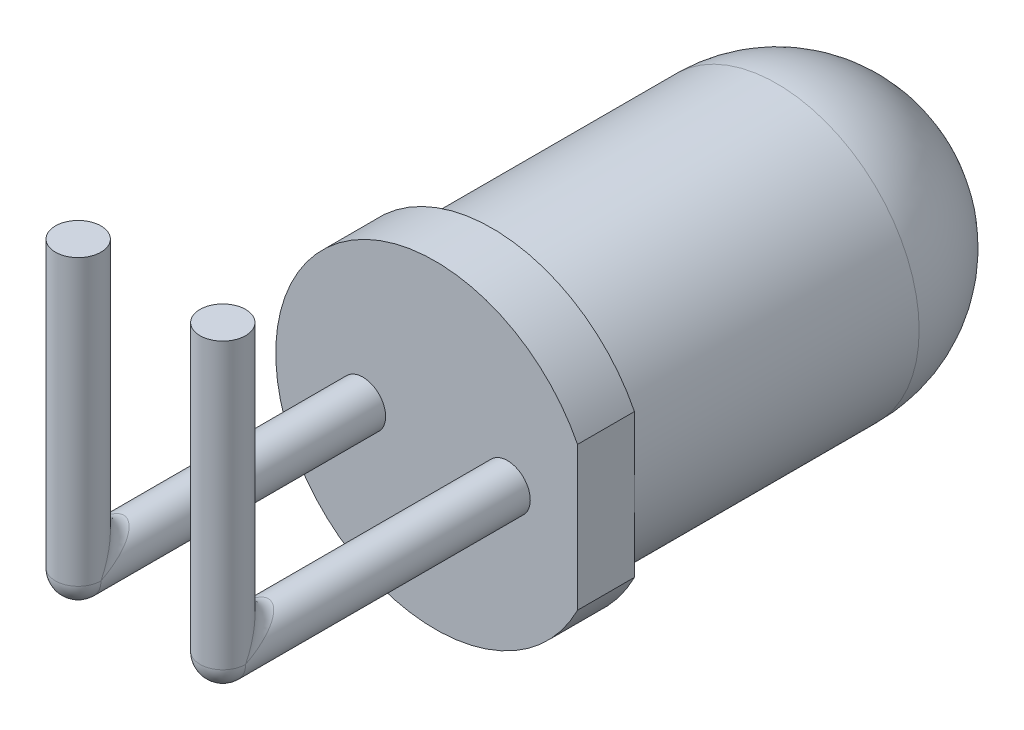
ISO-10303-21;
HEADER;
FILE_DESCRIPTION(('STEP AP214'),'2;1');
FILE_NAME('part.step','',(''),(''),'','','');
FILE_SCHEMA(('AUTOMOTIVE_DESIGN { 1 0 10303 214 1 1 1 1 }'));
ENDSEC;
DATA;
#1=APPLICATION_CONTEXT('core data for automotive mechanical design processes');
#2=APPLICATION_PROTOCOL_DEFINITION('international standard','automotive_design',2000,#1);
#3=PRODUCT_CONTEXT('',#1,'mechanical');
#4=PRODUCT('Part','Part','',(#3));
#5=PRODUCT_RELATED_PRODUCT_CATEGORY('part','',(#4));
#6=PRODUCT_DEFINITION_FORMATION('','',#4);
#7=PRODUCT_DEFINITION_CONTEXT('part definition',#1,'design');
#8=PRODUCT_DEFINITION('design','',#6,#7);
#9=PRODUCT_DEFINITION_SHAPE('','',#8);
#10=(LENGTH_UNIT() NAMED_UNIT(*) SI_UNIT(.MILLI.,.METRE.));
#11=(NAMED_UNIT(*) PLANE_ANGLE_UNIT() SI_UNIT($,.RADIAN.));
#12=(NAMED_UNIT(*) SI_UNIT($,.STERADIAN.) SOLID_ANGLE_UNIT());
#13=UNCERTAINTY_MEASURE_WITH_UNIT(LENGTH_MEASURE(1.E-05),#10,'distance_accuracy_value','');
#14=(GEOMETRIC_REPRESENTATION_CONTEXT(3) GLOBAL_UNCERTAINTY_ASSIGNED_CONTEXT((#13)) GLOBAL_UNIT_ASSIGNED_CONTEXT((#10,
#11,#12)) REPRESENTATION_CONTEXT('',''));
#15=CARTESIAN_POINT('',(0.,0.,0.));
#16=DIRECTION('',(0.,0.,1.));
#17=DIRECTION('',(1.,0.,0.));
#18=AXIS2_PLACEMENT_3D('',#15,#16,#17);
#19=CARTESIAN_POINT('',(0.,0.,8.5));
#20=DIRECTION('',(0.,0.,-1.));
#21=DIRECTION('',(-1.,0.,0.));
#22=AXIS2_PLACEMENT_3D('',#19,#20,#21);
#23=CYLINDRICAL_SURFACE('',#22,2.5);
#24=CARTESIAN_POINT('',(0.,0.,2.5));
#25=DIRECTION('',(0.,0.,-1.));
#26=DIRECTION('',(-1.,0.,0.));
#27=AXIS2_PLACEMENT_3D('',#24,#25,#26);
#28=CIRCLE('',#27,2.5);
#29=CARTESIAN_POINT('',(-2.5,0.,2.5));
#30=VERTEX_POINT('',#29);
#31=EDGE_CURVE('E100',#30,#30,#28,.F.);
#32=ORIENTED_EDGE('',*,*,#31,.T.);
#33=EDGE_LOOP('',(#32));
#34=FACE_BOUND('',#33,.T.);
#35=CARTESIAN_POINT('',(0.,0.,7.5));
#36=DIRECTION('',(0.,0.,1.));
#37=DIRECTION('',(1.,0.,0.));
#38=AXIS2_PLACEMENT_3D('',#35,#36,#37);
#39=CIRCLE('',#38,2.5);
#40=CARTESIAN_POINT('',(2.5,0.,7.5));
#41=VERTEX_POINT('',#40);
#42=EDGE_CURVE('E96',#41,#41,#39,.T.);
#43=ORIENTED_EDGE('',*,*,#42,.F.);
#44=EDGE_LOOP('',(#43));
#45=FACE_BOUND('',#44,.T.);
#46=ADVANCED_FACE('F29',(#34,#45),#23,.T.);
#47=CARTESIAN_POINT('',(0.,0.,7.5));
#48=DIRECTION('',(0.,0.,1.));
#49=DIRECTION('',(1.,0.,0.));
#50=AXIS2_PLACEMENT_3D('',#47,#48,#49);
#51=PLANE('',#50);
#52=DIRECTION('',(0.,1.,0.));
#53=VECTOR('',#52,1.);
#54=CARTESIAN_POINT('',(2.5,1.26095202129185,7.5));
#55=LINE('',#54,#53);
#56=CARTESIAN_POINT('',(2.5,1.26095202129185,7.5));
#57=VERTEX_POINT('',#56);
#58=EDGE_CURVE('E91',#41,#57,#55,.T.);
#59=ORIENTED_EDGE('',*,*,#58,.F.);
#60=ORIENTED_EDGE('',*,*,#42,.T.);
#61=CARTESIAN_POINT('',(2.5,-1.26095202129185,7.5));
#62=VERTEX_POINT('',#61);
#63=EDGE_CURVE('E81',#62,#41,#55,.T.);
#64=ORIENTED_EDGE('',*,*,#63,.F.);
#65=CARTESIAN_POINT('',(0.,0.,7.5));
#66=DIRECTION('',(0.,0.,1.));
#67=DIRECTION('',(1.,0.,0.));
#68=AXIS2_PLACEMENT_3D('',#65,#66,#67);
#69=CIRCLE('',#68,2.8);
#70=EDGE_CURVE('E75',#57,#62,#69,.T.);
#71=ORIENTED_EDGE('',*,*,#70,.F.);
#72=EDGE_LOOP('',(#59,#60,#64,#71));
#73=FACE_BOUND('',#72,.T.);
#74=ADVANCED_FACE('F141',(#73),#51,.F.);
#75=CARTESIAN_POINT('',(2.5,1.26095202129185,7.5));
#76=DIRECTION('',(1.,0.,0.));
#77=DIRECTION('',(0.,0.,-1.));
#78=AXIS2_PLACEMENT_3D('',#75,#76,#77);
#79=PLANE('',#78);
#80=ORIENTED_EDGE('',*,*,#63,.T.);
#81=ORIENTED_EDGE('',*,*,#58,.T.);
#82=DIRECTION('',(0.,0.,1.));
#83=VECTOR('',#82,1.);
#84=CARTESIAN_POINT('',(2.5,1.26095202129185,7.5));
#85=LINE('',#84,#83);
#86=CARTESIAN_POINT('',(2.5,1.26095202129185,8.5));
#87=VERTEX_POINT('',#86);
#88=EDGE_CURVE('E80',#57,#87,#85,.T.);
#89=ORIENTED_EDGE('',*,*,#88,.T.);
#90=DIRECTION('',(0.,1.,0.));
#91=VECTOR('',#90,1.);
#92=CARTESIAN_POINT('',(2.5,1.26095202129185,8.5));
#93=LINE('',#92,#91);
#94=CARTESIAN_POINT('',(2.5,-1.26095202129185,8.5));
#95=VERTEX_POINT('',#94);
#96=EDGE_CURVE('E85',#95,#87,#93,.T.);
#97=ORIENTED_EDGE('',*,*,#96,.F.);
#98=DIRECTION('',(0.,0.,1.));
#99=VECTOR('',#98,1.);
#100=CARTESIAN_POINT('',(2.5,-1.26095202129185,7.5));
#101=LINE('',#100,#99);
#102=EDGE_CURVE('E69',#62,#95,#101,.T.);
#103=ORIENTED_EDGE('',*,*,#102,.F.);
#104=EDGE_LOOP('',(#80,#81,#89,#97,#103));
#105=FACE_BOUND('',#104,.T.);
#106=ADVANCED_FACE('F89',(#105),#79,.T.);
#107=CARTESIAN_POINT('',(0.,0.,7.5));
#108=DIRECTION('',(0.,0.,1.));
#109=DIRECTION('',(1.,0.,0.));
#110=AXIS2_PLACEMENT_3D('',#107,#108,#109);
#111=CYLINDRICAL_SURFACE('',#110,2.8);
#112=CARTESIAN_POINT('',(0.,0.,8.5));
#113=DIRECTION('',(0.,0.,1.));
#114=DIRECTION('',(1.,0.,0.));
#115=AXIS2_PLACEMENT_3D('',#112,#113,#114);
#116=CIRCLE('',#115,2.8);
#117=EDGE_CURVE('E73',#87,#95,#116,.T.);
#118=ORIENTED_EDGE('',*,*,#117,.F.);
#119=ORIENTED_EDGE('',*,*,#88,.F.);
#120=ORIENTED_EDGE('',*,*,#70,.T.);
#121=ORIENTED_EDGE('',*,*,#102,.T.);
#122=EDGE_LOOP('',(#118,#119,#120,#121));
#123=FACE_BOUND('',#122,.T.);
#124=ADVANCED_FACE('F71',(#123),#111,.T.);
#125=CARTESIAN_POINT('',(0.,0.,8.5));
#126=DIRECTION('',(0.,0.,1.));
#127=DIRECTION('',(1.,0.,0.));
#128=AXIS2_PLACEMENT_3D('',#125,#126,#127);
#129=PLANE('',#128);
#130=CARTESIAN_POINT('',(-1.27,0.,8.5));
#131=DIRECTION('',(0.,0.,1.));
#132=DIRECTION('',(1.,0.,0.));
#133=AXIS2_PLACEMENT_3D('',#130,#131,#132);
#134=CIRCLE('',#133,0.4);
#135=CARTESIAN_POINT('',(-0.87,0.,8.5));
#136=VERTEX_POINT('',#135);
#137=EDGE_CURVE('E108',#136,#136,#134,.T.);
#138=ORIENTED_EDGE('',*,*,#137,.F.);
#139=EDGE_LOOP('',(#138));
#140=FACE_BOUND('',#139,.T.);
#141=CARTESIAN_POINT('',(1.27,0.,8.5));
#142=DIRECTION('',(0.,0.,1.));
#143=DIRECTION('',(1.,0.,0.));
#144=AXIS2_PLACEMENT_3D('',#141,#142,#143);
#145=CIRCLE('',#144,0.4);
#146=CARTESIAN_POINT('',(1.67,0.,8.5));
#147=VERTEX_POINT('',#146);
#148=EDGE_CURVE('E103',#147,#147,#145,.T.);
#149=ORIENTED_EDGE('',*,*,#148,.F.);
#150=EDGE_LOOP('',(#149));
#151=FACE_BOUND('',#150,.T.);
#152=ORIENTED_EDGE('',*,*,#96,.T.);
#153=ORIENTED_EDGE('',*,*,#117,.T.);
#154=EDGE_LOOP('',(#152,#153));
#155=FACE_BOUND('',#154,.T.);
#156=ADVANCED_FACE('F84',(#140,#151,#155),#129,.T.);
#157=CARTESIAN_POINT('',(0.,0.,2.5));
#158=DIRECTION('',(0.,0.,1.));
#159=DIRECTION('',(1.,0.,0.));
#160=AXIS2_PLACEMENT_3D('',#157,#158,#159);
#161=SPHERICAL_SURFACE('',#160,2.5);
#162=ORIENTED_EDGE('',*,*,#31,.F.);
#163=EDGE_LOOP('',(#162));
#164=FACE_BOUND('',#163,.T.);
#165=ADVANCED_FACE('F154',(#164),#161,.T.);
#166=CARTESIAN_POINT('',(1.27,0.,13.5));
#167=DIRECTION('',(0.,1.,0.));
#168=DIRECTION('',(0.,0.,1.));
#169=AXIS2_PLACEMENT_3D('',#166,#167,#168);
#170=CYLINDRICAL_SURFACE('',#169,0.4);
#171=CARTESIAN_POINT('',(1.27,0.,13.5));
#172=DIRECTION('',(0.,-0.447213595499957,-0.894427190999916));
#173=DIRECTION('',(0.,0.894427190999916,-0.447213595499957));
#174=AXIS2_PLACEMENT_3D('',#171,#172,#173);
#175=ELLIPSE('',#174,0.894427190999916,0.4);
#176=CARTESIAN_POINT('',(1.67,0.,13.5));
#177=VERTEX_POINT('',#176);
#178=CARTESIAN_POINT('',(0.87,0.,13.5));
#179=VERTEX_POINT('',#178);
#180=EDGE_CURVE('E104',#177,#179,#175,.F.);
#181=ORIENTED_EDGE('',*,*,#180,.T.);
#182=CARTESIAN_POINT('',(1.27,0.,13.5));
#183=DIRECTION('',(0.,1.,0.));
#184=DIRECTION('',(0.,0.,1.));
#185=AXIS2_PLACEMENT_3D('',#182,#183,#184);
#186=CIRCLE('',#185,0.4);
#187=EDGE_CURVE('E107',#179,#177,#186,.T.);
#188=ORIENTED_EDGE('',*,*,#187,.T.);
#189=EDGE_LOOP('',(#181,#188));
#190=FACE_BOUND('',#189,.T.);
#191=CARTESIAN_POINT('',(1.27,5.,13.5));
#192=DIRECTION('',(0.,1.,0.));
#193=DIRECTION('',(0.,0.,1.));
#194=AXIS2_PLACEMENT_3D('',#191,#192,#193);
#195=CIRCLE('',#194,0.4);
#196=CARTESIAN_POINT('',(1.27,5.,13.9));
#197=VERTEX_POINT('',#196);
#198=EDGE_CURVE('E87',#197,#197,#195,.F.);
#199=ORIENTED_EDGE('',*,*,#198,.T.);
#200=EDGE_LOOP('',(#199));
#201=FACE_BOUND('',#200,.T.);
#202=ADVANCED_FACE('F155',(#190,#201),#170,.T.);
#203=CARTESIAN_POINT('',(1.27,0.,14.6313708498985));
#204=DIRECTION('',(0.,0.,-1.));
#205=DIRECTION('',(0.,1.,0.));
#206=AXIS2_PLACEMENT_3D('',#203,#204,#205);
#207=CYLINDRICAL_SURFACE('',#206,0.4);
#208=ORIENTED_EDGE('',*,*,#148,.T.);
#209=EDGE_LOOP('',(#208));
#210=FACE_BOUND('',#209,.T.);
#211=CARTESIAN_POINT('',(1.27,0.,13.5));
#212=DIRECTION('',(0.,0.,-1.));
#213=DIRECTION('',(0.,1.,0.));
#214=AXIS2_PLACEMENT_3D('',#211,#212,#213);
#215=CIRCLE('',#214,0.4);
#216=EDGE_CURVE('E111',#177,#179,#215,.T.);
#217=ORIENTED_EDGE('',*,*,#216,.T.);
#218=CARTESIAN_POINT('',(1.27,0.,13.5));
#219=DIRECTION('',(0.,-0.894427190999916,-0.447213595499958));
#220=DIRECTION('',(0.,0.447213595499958,-0.894427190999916));
#221=AXIS2_PLACEMENT_3D('',#218,#219,#220);
#222=ELLIPSE('',#221,0.894427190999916,0.4);
#223=EDGE_CURVE('E114',#179,#177,#222,.T.);
#224=ORIENTED_EDGE('',*,*,#223,.T.);
#225=EDGE_LOOP('',(#217,#224));
#226=FACE_BOUND('',#225,.T.);
#227=ADVANCED_FACE('F161',(#210,#226),#207,.T.);
#228=CARTESIAN_POINT('',(1.27,5.,13.5));
#229=DIRECTION('',(0.,1.,0.));
#230=DIRECTION('',(0.,0.,1.));
#231=AXIS2_PLACEMENT_3D('',#228,#229,#230);
#232=PLANE('',#231);
#233=ORIENTED_EDGE('',*,*,#198,.F.);
#234=EDGE_LOOP('',(#233));
#235=FACE_BOUND('',#234,.T.);
#236=ADVANCED_FACE('F204',(#235),#232,.T.);
#237=CARTESIAN_POINT('',(-1.27,0.,13.5));
#238=DIRECTION('',(0.,1.,0.));
#239=DIRECTION('',(0.,0.,1.));
#240=AXIS2_PLACEMENT_3D('',#237,#238,#239);
#241=CYLINDRICAL_SURFACE('',#240,0.4);
#242=CARTESIAN_POINT('',(-1.27,0.,13.5));
#243=DIRECTION('',(0.,-0.447213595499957,-0.894427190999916));
#244=DIRECTION('',(0.,0.894427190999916,-0.447213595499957));
#245=AXIS2_PLACEMENT_3D('',#242,#243,#244);
#246=ELLIPSE('',#245,0.894427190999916,0.4);
#247=CARTESIAN_POINT('',(-0.87,0.,13.5));
#248=VERTEX_POINT('',#247);
#249=CARTESIAN_POINT('',(-1.67,0.,13.5));
#250=VERTEX_POINT('',#249);
#251=EDGE_CURVE('E117',#248,#250,#246,.F.);
#252=ORIENTED_EDGE('',*,*,#251,.T.);
#253=CARTESIAN_POINT('',(-1.27,0.,13.5));
#254=DIRECTION('',(0.,1.,0.));
#255=DIRECTION('',(0.,0.,1.));
#256=AXIS2_PLACEMENT_3D('',#253,#254,#255);
#257=CIRCLE('',#256,0.4);
#258=EDGE_CURVE('E120',#250,#248,#257,.T.);
#259=ORIENTED_EDGE('',*,*,#258,.T.);
#260=EDGE_LOOP('',(#252,#259));
#261=FACE_BOUND('',#260,.T.);
#262=CARTESIAN_POINT('',(-1.27,5.,13.5));
#263=DIRECTION('',(0.,1.,0.));
#264=DIRECTION('',(0.,0.,1.));
#265=AXIS2_PLACEMENT_3D('',#262,#263,#264);
#266=CIRCLE('',#265,0.4);
#267=CARTESIAN_POINT('',(-1.27,5.,13.9));
#268=VERTEX_POINT('',#267);
#269=EDGE_CURVE('E263',#268,#268,#266,.F.);
#270=ORIENTED_EDGE('',*,*,#269,.T.);
#271=EDGE_LOOP('',(#270));
#272=FACE_BOUND('',#271,.T.);
#273=ADVANCED_FACE('F125',(#261,#272),#241,.T.);
#274=CARTESIAN_POINT('',(-1.27,0.,14.6313708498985));
#275=DIRECTION('',(0.,0.,-1.));
#276=DIRECTION('',(0.,1.,0.));
#277=AXIS2_PLACEMENT_3D('',#274,#275,#276);
#278=CYLINDRICAL_SURFACE('',#277,0.4);
#279=ORIENTED_EDGE('',*,*,#137,.T.);
#280=EDGE_LOOP('',(#279));
#281=FACE_BOUND('',#280,.T.);
#282=CARTESIAN_POINT('',(-1.27,0.,13.5));
#283=DIRECTION('',(0.,0.,-1.));
#284=DIRECTION('',(0.,1.,0.));
#285=AXIS2_PLACEMENT_3D('',#282,#283,#284);
#286=CIRCLE('',#285,0.4);
#287=EDGE_CURVE('E36',#248,#250,#286,.T.);
#288=ORIENTED_EDGE('',*,*,#287,.T.);
#289=CARTESIAN_POINT('',(-1.27,0.,13.5));
#290=DIRECTION('',(0.,-0.894427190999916,-0.447213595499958));
#291=DIRECTION('',(0.,0.447213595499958,-0.894427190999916));
#292=AXIS2_PLACEMENT_3D('',#289,#290,#291);
#293=ELLIPSE('',#292,0.894427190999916,0.4);
#294=EDGE_CURVE('E12',#250,#248,#293,.T.);
#295=ORIENTED_EDGE('',*,*,#294,.T.);
#296=EDGE_LOOP('',(#288,#295));
#297=FACE_BOUND('',#296,.T.);
#298=ADVANCED_FACE('F123',(#281,#297),#278,.T.);
#299=CARTESIAN_POINT('',(-1.27,5.,13.5));
#300=DIRECTION('',(0.,1.,0.));
#301=DIRECTION('',(0.,0.,1.));
#302=AXIS2_PLACEMENT_3D('',#299,#300,#301);
#303=PLANE('',#302);
#304=ORIENTED_EDGE('',*,*,#269,.F.);
#305=EDGE_LOOP('',(#304));
#306=FACE_BOUND('',#305,.T.);
#307=ADVANCED_FACE('F223',(#306),#303,.T.);
#308=CARTESIAN_POINT('',(1.27,0.,13.5));
#309=DIRECTION('',(0.,0.,1.));
#310=DIRECTION('',(1.,0.,0.));
#311=AXIS2_PLACEMENT_3D('',#308,#309,#310);
#312=SPHERICAL_SURFACE('',#311,0.4);
#313=ORIENTED_EDGE('',*,*,#187,.F.);
#314=ORIENTED_EDGE('',*,*,#216,.F.);
#315=EDGE_LOOP('',(#313,#314));
#316=FACE_BOUND('',#315,.T.);
#317=ADVANCED_FACE('F137',(#316),#312,.T.);
#318=CARTESIAN_POINT('',(1.67,0.,13.5));
#319=CARTESIAN_POINT('',(1.67,0.,13.5));
#320=CARTESIAN_POINT('',(1.67,0.,13.5));
#321=CARTESIAN_POINT('',(1.66999298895,0.0348517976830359,13.4825741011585));
#322=CARTESIAN_POINT('',(1.67005108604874,0.0261441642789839,13.473855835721));
#323=CARTESIAN_POINT('',(1.66999298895,0.0174258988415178,13.465148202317));
#324=CARTESIAN_POINT('',(1.66886070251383,0.0697124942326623,13.4651437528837));
#325=CARTESIAN_POINT('',(1.66772093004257,0.0523600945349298,13.4476399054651));
#326=CARTESIAN_POINT('',(1.66886070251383,0.034856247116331,13.4302875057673));
#327=CARTESIAN_POINT('',(1.66431458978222,0.138834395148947,13.4305828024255));
#328=CARTESIAN_POINT('',(1.65863330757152,0.103749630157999,13.396250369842));
#329=CARTESIAN_POINT('',(1.66431458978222,0.0694171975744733,13.3611656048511));
#330=CARTESIAN_POINT('',(1.66092023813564,0.173098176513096,13.4134509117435));
#331=CARTESIAN_POINT('',(1.65186272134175,0.129071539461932,13.3709284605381));
#332=CARTESIAN_POINT('',(1.66092023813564,0.0865490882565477,13.3269018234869));
#333=CARTESIAN_POINT('',(1.65189673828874,0.24044273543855,13.3797786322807));
#334=CARTESIAN_POINT('',(1.63414910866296,0.177786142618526,13.3222138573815));
#335=CARTESIAN_POINT('',(1.65189673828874,0.120221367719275,13.2595572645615));
#336=CARTESIAN_POINT('',(1.6463060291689,0.273533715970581,13.3632331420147));
#337=CARTESIAN_POINT('',(1.62318021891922,0.201325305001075,13.2986746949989));
#338=CARTESIAN_POINT('',(1.6463060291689,0.136766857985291,13.2264662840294));
#339=CARTESIAN_POINT('',(1.63296398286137,0.337956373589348,13.3310218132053));
#340=CARTESIAN_POINT('',(1.59763412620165,0.245616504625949,13.2543834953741));
#341=CARTESIAN_POINT('',(1.63296398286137,0.168978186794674,13.1620436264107));
#342=CARTESIAN_POINT('',(1.62526926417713,0.369311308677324,13.3153443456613));
#343=CARTESIAN_POINT('',(1.58301825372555,0.266510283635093,13.2334897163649));
#344=CARTESIAN_POINT('',(1.62526926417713,0.184655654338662,13.1306886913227));
#345=CARTESIAN_POINT('',(1.60783304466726,0.42971186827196,13.285144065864));
#346=CARTESIAN_POINT('',(1.55100028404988,0.304712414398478,13.1952875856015));
#347=CARTESIAN_POINT('',(1.60783304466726,0.21485593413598,13.070288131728));
#348=CARTESIAN_POINT('',(1.59816448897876,0.458799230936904,13.2706003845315));
#349=CARTESIAN_POINT('',(1.53354818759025,0.322154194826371,13.1778458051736));
#350=CARTESIAN_POINT('',(1.59816448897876,0.229399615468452,13.0412007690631));
#351=CARTESIAN_POINT('',(1.57692939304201,0.514147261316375,13.2429263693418));
#352=CARTESIAN_POINT('',(1.49701863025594,0.352779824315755,13.1472201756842));
#353=CARTESIAN_POINT('',(1.57692939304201,0.257073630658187,12.9858527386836));
#354=CARTESIAN_POINT('',(1.56544892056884,0.540473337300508,13.2297633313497));
#355=CARTESIAN_POINT('',(1.47788315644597,0.366083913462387,13.1339160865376));
#356=CARTESIAN_POINT('',(1.56544892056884,0.270236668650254,12.9595266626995));
#357=CARTESIAN_POINT('',(1.54077355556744,0.589823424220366,13.2050882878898));
#358=CARTESIAN_POINT('',(1.43951787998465,0.388004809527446,13.1119951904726));
#359=CARTESIAN_POINT('',(1.54077355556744,0.294911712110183,12.9101765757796));
#360=CARTESIAN_POINT('',(1.52767253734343,0.612940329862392,13.1935298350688));
#361=CARTESIAN_POINT('',(1.42022816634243,0.396723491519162,13.1032765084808));
#362=CARTESIAN_POINT('',(1.52767253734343,0.306470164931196,12.8870596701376));
#363=CARTESIAN_POINT('',(1.49997342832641,0.655447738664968,13.1722761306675));
#364=CARTESIAN_POINT('',(1.38341468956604,0.409472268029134,13.0905277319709));
#365=CARTESIAN_POINT('',(1.49997342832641,0.327723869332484,12.844552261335));
#366=CARTESIAN_POINT('',(1.48546909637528,0.674959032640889,13.1625204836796));
#367=CARTESIAN_POINT('',(1.36583761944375,0.413582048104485,13.0864179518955));
#368=CARTESIAN_POINT('',(1.48546909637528,0.337479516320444,12.8250409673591));
#369=CARTESIAN_POINT('',(1.45521408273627,0.709892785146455,13.1450536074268));
#370=CARTESIAN_POINT('',(1.33439698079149,0.417771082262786,13.0822289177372));
#371=CARTESIAN_POINT('',(1.45521408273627,0.354946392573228,12.7901072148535));
#372=CARTESIAN_POINT('',(1.43954673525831,0.725457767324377,13.1372711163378));
#373=CARTESIAN_POINT('',(1.32049509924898,0.417907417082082,13.0820925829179));
#374=CARTESIAN_POINT('',(1.43954673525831,0.362728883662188,12.7745422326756));
#375=CARTESIAN_POINT('',(1.40724861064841,0.752212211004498,13.1238938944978));
#376=CARTESIAN_POINT('',(1.2978686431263,0.415624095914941,13.0843759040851));
#377=CARTESIAN_POINT('',(1.40724861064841,0.376106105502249,12.7477877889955));
#378=CARTESIAN_POINT('',(1.39068005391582,0.763549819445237,13.1182250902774));
#379=CARTESIAN_POINT('',(1.28912434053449,0.413242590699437,13.0867574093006));
#380=CARTESIAN_POINT('',(1.39068005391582,0.381774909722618,12.7364501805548));
#381=CARTESIAN_POINT('',(1.35689020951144,0.781655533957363,13.1091722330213));
#382=CARTESIAN_POINT('',(1.2769352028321,0.40803809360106,13.0919619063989));
#383=CARTESIAN_POINT('',(1.35689020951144,0.390827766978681,12.7183444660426));
#384=CARTESIAN_POINT('',(1.33970345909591,0.788550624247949,13.105724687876));
#385=CARTESIAN_POINT('',(1.27348474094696,0.405239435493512,13.0947605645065));
#386=CARTESIAN_POINT('',(1.33970345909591,0.394275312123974,12.7114493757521));
#387=CARTESIAN_POINT('',(1.30500449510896,0.797685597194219,13.1011572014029));
#388=CARTESIAN_POINT('',(1.27002308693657,0.401214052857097,13.0987859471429));
#389=CARTESIAN_POINT('',(1.30500449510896,0.398842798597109,12.7023144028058));
#390=CARTESIAN_POINT('',(1.28750224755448,0.8,13.1));
#391=CARTESIAN_POINT('',(1.27001157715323,0.4,13.1));
#392=CARTESIAN_POINT('',(1.28750224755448,0.4,12.7));
#393=CARTESIAN_POINT('',(1.25249775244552,0.8,13.1));
#394=CARTESIAN_POINT('',(1.26998842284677,0.4,13.1));
#395=CARTESIAN_POINT('',(1.25249775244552,0.4,12.7));
#396=CARTESIAN_POINT('',(1.23499550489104,0.797685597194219,13.1011572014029));
#397=CARTESIAN_POINT('',(1.26997691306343,0.401214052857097,13.0987859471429));
#398=CARTESIAN_POINT('',(1.23499550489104,0.398842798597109,12.7023144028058));
#399=CARTESIAN_POINT('',(1.20029654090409,0.788550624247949,13.105724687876));
#400=CARTESIAN_POINT('',(1.26651525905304,0.405239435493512,13.0947605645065));
#401=CARTESIAN_POINT('',(1.20029654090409,0.394275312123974,12.7114493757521));
#402=CARTESIAN_POINT('',(1.18310979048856,0.781655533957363,13.1091722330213));
#403=CARTESIAN_POINT('',(1.2630647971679,0.40803809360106,13.0919619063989));
#404=CARTESIAN_POINT('',(1.18310979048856,0.390827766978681,12.7183444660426));
#405=CARTESIAN_POINT('',(1.14931994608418,0.763549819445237,13.1182250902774));
#406=CARTESIAN_POINT('',(1.25087565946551,0.413242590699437,13.0867574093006));
#407=CARTESIAN_POINT('',(1.14931994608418,0.381774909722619,12.7364501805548));
#408=CARTESIAN_POINT('',(1.13275138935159,0.752212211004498,13.1238938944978));
#409=CARTESIAN_POINT('',(1.2421313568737,0.415624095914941,13.0843759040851));
#410=CARTESIAN_POINT('',(1.13275138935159,0.376106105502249,12.7477877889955));
#411=CARTESIAN_POINT('',(1.10045326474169,0.725457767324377,13.1372711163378));
#412=CARTESIAN_POINT('',(1.21950490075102,0.417907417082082,13.0820925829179));
#413=CARTESIAN_POINT('',(1.10045326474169,0.362728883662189,12.7745422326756));
#414=CARTESIAN_POINT('',(1.08478591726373,0.709892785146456,13.1450536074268));
#415=CARTESIAN_POINT('',(1.20560301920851,0.417771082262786,13.0822289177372));
#416=CARTESIAN_POINT('',(1.08478591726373,0.354946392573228,12.7901072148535));
#417=CARTESIAN_POINT('',(1.05453090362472,0.67495903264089,13.1625204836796));
#418=CARTESIAN_POINT('',(1.17416238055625,0.413582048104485,13.0864179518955));
#419=CARTESIAN_POINT('',(1.05453090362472,0.337479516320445,12.8250409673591));
#420=CARTESIAN_POINT('',(1.04002657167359,0.655447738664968,13.1722761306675));
#421=CARTESIAN_POINT('',(1.15658531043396,0.409472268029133,13.0905277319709));
#422=CARTESIAN_POINT('',(1.04002657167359,0.327723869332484,12.844552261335));
#423=CARTESIAN_POINT('',(1.01232746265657,0.612940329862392,13.1935298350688));
#424=CARTESIAN_POINT('',(1.11977183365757,0.396723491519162,13.1032765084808));
#425=CARTESIAN_POINT('',(1.01232746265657,0.306470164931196,12.8870596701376));
#426=CARTESIAN_POINT('',(0.999226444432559,0.589823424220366,13.2050882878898));
#427=CARTESIAN_POINT('',(1.10048212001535,0.388004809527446,13.1119951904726));
#428=CARTESIAN_POINT('',(0.999226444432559,0.294911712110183,12.9101765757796));
#429=CARTESIAN_POINT('',(0.974551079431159,0.540473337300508,13.2297633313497));
#430=CARTESIAN_POINT('',(1.06211684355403,0.366083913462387,13.1339160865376));
#431=CARTESIAN_POINT('',(0.974551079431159,0.270236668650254,12.9595266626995));
#432=CARTESIAN_POINT('',(0.963070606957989,0.514147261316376,13.2429263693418));
#433=CARTESIAN_POINT('',(1.04298136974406,0.352779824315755,13.1472201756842));
#434=CARTESIAN_POINT('',(0.963070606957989,0.257073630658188,12.9858527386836));
#435=CARTESIAN_POINT('',(0.941835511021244,0.458799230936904,13.2706003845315));
#436=CARTESIAN_POINT('',(1.00645181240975,0.322154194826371,13.1778458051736));
#437=CARTESIAN_POINT('',(0.941835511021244,0.229399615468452,13.0412007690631));
#438=CARTESIAN_POINT('',(0.932166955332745,0.42971186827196,13.285144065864));
#439=CARTESIAN_POINT('',(0.988999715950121,0.304712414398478,13.1952875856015));
#440=CARTESIAN_POINT('',(0.932166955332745,0.21485593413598,13.070288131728));
#441=CARTESIAN_POINT('',(0.91473073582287,0.369311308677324,13.3153443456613));
#442=CARTESIAN_POINT('',(0.956981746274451,0.266510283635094,13.2334897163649));
#443=CARTESIAN_POINT('',(0.91473073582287,0.184655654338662,13.1306886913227));
#444=CARTESIAN_POINT('',(0.907036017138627,0.337956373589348,13.3310218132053));
#445=CARTESIAN_POINT('',(0.942365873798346,0.245616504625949,13.2543834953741));
#446=CARTESIAN_POINT('',(0.907036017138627,0.168978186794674,13.1620436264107));
#447=CARTESIAN_POINT('',(0.893693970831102,0.273533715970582,13.3632331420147));
#448=CARTESIAN_POINT('',(0.916819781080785,0.201325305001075,13.2986746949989));
#449=CARTESIAN_POINT('',(0.893693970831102,0.136766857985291,13.2264662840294));
#450=CARTESIAN_POINT('',(0.888103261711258,0.240442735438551,13.3797786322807));
#451=CARTESIAN_POINT('',(0.905850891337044,0.177786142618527,13.3222138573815));
#452=CARTESIAN_POINT('',(0.888103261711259,0.120221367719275,13.2595572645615));
#453=CARTESIAN_POINT('',(0.879079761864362,0.173098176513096,13.4134509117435));
#454=CARTESIAN_POINT('',(0.888137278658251,0.129071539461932,13.3709284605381));
#455=CARTESIAN_POINT('',(0.879079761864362,0.086549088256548,13.3269018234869));
#456=CARTESIAN_POINT('',(0.87568541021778,0.138834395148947,13.4305828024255));
#457=CARTESIAN_POINT('',(0.881366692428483,0.103749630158,13.396250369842));
#458=CARTESIAN_POINT('',(0.87568541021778,0.0694171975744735,13.3611656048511));
#459=CARTESIAN_POINT('',(0.871139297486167,0.0697124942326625,13.4651437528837));
#460=CARTESIAN_POINT('',(0.872279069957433,0.05236009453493,13.4476399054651));
#461=CARTESIAN_POINT('',(0.871139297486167,0.0348562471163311,13.4302875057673));
#462=CARTESIAN_POINT('',(0.870007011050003,0.034851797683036,13.4825741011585));
#463=CARTESIAN_POINT('',(0.869948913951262,0.026144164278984,13.473855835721));
#464=CARTESIAN_POINT('',(0.870007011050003,0.0174258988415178,13.465148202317));
#465=CARTESIAN_POINT('',(0.87,0.,13.5));
#466=CARTESIAN_POINT('',(0.87,0.,13.5));
#467=CARTESIAN_POINT('',(0.87,0.,13.5));
#468=(BOUNDED_SURFACE() B_SPLINE_SURFACE(3,2,((#318,#319,#320),(#321,#322,#323),(#324,#325,
#326),(#327,#328,#329),(#330,#331,#332),(#333,#334,#335),(#336,#337,#338),(#339,#340,#341),
(#342,#343,#344),(#345,#346,#347),(#348,#349,#350),(#351,#352,#353),(#354,#355,#356),(#357,#358,
#359),(#360,#361,#362),(#363,#364,#365),(#366,#367,#368),(#369,#370,#371),(#372,#373,#374),
(#375,#376,#377),(#378,#379,#380),(#381,#382,#383),(#384,#385,#386),(#387,#388,#389),(#390,#391,
#392),(#393,#394,#395),(#396,#397,#398),(#399,#400,#401),(#402,#403,#404),(#405,#406,#407),
(#408,#409,#410),(#411,#412,#413),(#414,#415,#416),(#417,#418,#419),(#420,#421,#422),(#423,#424,
#425),(#426,#427,#428),(#429,#430,#431),(#432,#433,#434),(#435,#436,#437),(#438,#439,#440),
(#441,#442,#443),(#444,#445,#446),(#447,#448,#449),(#450,#451,#452),(#453,#454,#455),(#456,#457,
#458),(#459,#460,#461),(#462,#463,#464),(#465,#466,#467)),.UNSPECIFIED.,.F.,.F.,
.F.) B_SPLINE_SURFACE_WITH_KNOTS((4,2,2,2,2,2,2,2,2,2,2,2,2,2,2,2,2,2,2,2,2,2,2,2,4),(3,3),(0.,
0.147832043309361,0.294407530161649,0.438524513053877,0.579091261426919,0.715183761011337,
0.846105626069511,0.971449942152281,1.09116027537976,1.2055837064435,1.31550198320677,
1.42211980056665,1.52698838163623,1.63185696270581,1.73847478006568,1.84839305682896,
1.9628164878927,2.08252682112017,2.20787113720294,2.33879300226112,2.47488550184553,
2.61545225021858,2.7595692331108,2.90614471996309,3.05397676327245),(0.,1.),
.UNSPECIFIED.) GEOMETRIC_REPRESENTATION_ITEM() RATIONAL_B_SPLINE_SURFACE(((1.,1.,1.),(1.,
1.00000566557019,1.),(1.,0.998576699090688,1.),(1.,0.992910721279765,1.),(1.,0.988697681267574,
1.),(1.,0.97761712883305,1.),(1.,0.970795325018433,1.),(1.,0.954789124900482,1.),(1.,
0.945667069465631,1.),(1.,0.92548796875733,1.),(1.,0.914501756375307,1.),(1.,0.891169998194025,
1.),(1.,0.878891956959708,1.),(1.,0.853706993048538,1.),(1.,0.840849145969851,1.),(1.,
0.815387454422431,1.),(1.,0.802798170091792,1.),(1.,0.778880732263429,1.),(1.,0.767521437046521,
1.),(1.,0.747118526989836,1.),(1.,0.738001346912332,1.),(1.,0.723039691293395,1.),(1.,
0.717105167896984,1.),(1.,0.709170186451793,1.),(1.,0.707106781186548,1.),(1.,0.707106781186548,
1.),(1.,0.709170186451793,1.),(1.,0.717105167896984,1.),(1.,0.723039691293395,1.),(1.,
0.738001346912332,1.),(1.,0.747118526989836,1.),(1.,0.767521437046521,1.),(1.,0.778880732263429,
1.),(1.,0.802798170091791,1.),(1.,0.815387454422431,1.),(1.,0.84084914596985,1.),(1.,
0.853706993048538,1.),(1.,0.878891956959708,1.),(1.,0.891169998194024,1.),(1.,0.914501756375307,
1.),(1.,0.92548796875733,1.),(1.,0.945667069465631,1.),(1.,0.954789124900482,1.),(1.,
0.970795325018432,1.),(1.,0.977617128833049,1.),(1.,0.988697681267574,1.),(1.,0.992910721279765,
1.),(1.,0.998576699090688,1.),(1.,1.00000566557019,1.),(1.,1.,1.))) REPRESENTATION_ITEM('') SURFACE());
#469=ORIENTED_EDGE('',*,*,#180,.F.);
#470=ORIENTED_EDGE('',*,*,#223,.F.);
#471=EDGE_LOOP('',(#469,#470));
#472=FACE_BOUND('',#471,.T.);
#473=ADVANCED_FACE('F130',(#472),#468,.F.);
#474=CARTESIAN_POINT('',(-1.27,0.,13.5));
#475=DIRECTION('',(0.,0.,1.));
#476=DIRECTION('',(1.,0.,0.));
#477=AXIS2_PLACEMENT_3D('',#474,#475,#476);
#478=SPHERICAL_SURFACE('',#477,0.4);
#479=ORIENTED_EDGE('',*,*,#258,.F.);
#480=ORIENTED_EDGE('',*,*,#287,.F.);
#481=EDGE_LOOP('',(#479,#480));
#482=FACE_BOUND('',#481,.T.);
#483=ADVANCED_FACE('F127',(#482),#478,.T.);
#484=CARTESIAN_POINT('',(-0.87,0.,13.5));
#485=CARTESIAN_POINT('',(-0.87,0.,13.5));
#486=CARTESIAN_POINT('',(-0.87,0.,13.5));
#487=CARTESIAN_POINT('',(-0.870007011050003,0.0348517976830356,13.4825741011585));
#488=CARTESIAN_POINT('',(-0.869948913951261,0.0261441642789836,13.473855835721));
#489=CARTESIAN_POINT('',(-0.870007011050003,0.0174258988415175,13.465148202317));
#490=CARTESIAN_POINT('',(-0.871139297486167,0.0697124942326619,13.4651437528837));
#491=CARTESIAN_POINT('',(-0.872279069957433,0.0523600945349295,13.4476399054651));
#492=CARTESIAN_POINT('',(-0.871139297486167,0.0348562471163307,13.4302875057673));
#493=CARTESIAN_POINT('',(-0.87568541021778,0.138834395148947,13.4305828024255));
#494=CARTESIAN_POINT('',(-0.881366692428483,0.103749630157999,13.396250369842));
#495=CARTESIAN_POINT('',(-0.875685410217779,0.069417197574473,13.3611656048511));
#496=CARTESIAN_POINT('',(-0.879079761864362,0.173098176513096,13.4134509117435));
#497=CARTESIAN_POINT('',(-0.88813727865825,0.129071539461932,13.3709284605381));
#498=CARTESIAN_POINT('',(-0.879079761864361,0.0865490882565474,13.3269018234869));
#499=CARTESIAN_POINT('',(-0.888103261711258,0.24044273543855,13.3797786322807));
#500=CARTESIAN_POINT('',(-0.905850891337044,0.177786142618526,13.3222138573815));
#501=CARTESIAN_POINT('',(-0.888103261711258,0.120221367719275,13.2595572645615));
#502=CARTESIAN_POINT('',(-0.893693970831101,0.273533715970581,13.3632331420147));
#503=CARTESIAN_POINT('',(-0.916819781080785,0.201325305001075,13.2986746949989));
#504=CARTESIAN_POINT('',(-0.893693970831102,0.13676685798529,13.2264662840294));
#505=CARTESIAN_POINT('',(-0.907036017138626,0.337956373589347,13.3310218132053));
#506=CARTESIAN_POINT('',(-0.942365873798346,0.245616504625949,13.2543834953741));
#507=CARTESIAN_POINT('',(-0.907036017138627,0.168978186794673,13.1620436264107));
#508=CARTESIAN_POINT('',(-0.914730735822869,0.369311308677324,13.3153443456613));
#509=CARTESIAN_POINT('',(-0.956981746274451,0.266510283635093,13.2334897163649));
#510=CARTESIAN_POINT('',(-0.914730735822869,0.184655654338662,13.1306886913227));
#511=CARTESIAN_POINT('',(-0.932166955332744,0.429711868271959,13.285144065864));
#512=CARTESIAN_POINT('',(-0.98899971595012,0.304712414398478,13.1952875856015));
#513=CARTESIAN_POINT('',(-0.932166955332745,0.214855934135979,13.070288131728));
#514=CARTESIAN_POINT('',(-0.941835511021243,0.458799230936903,13.2706003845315));
#515=CARTESIAN_POINT('',(-1.00645181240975,0.32215419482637,13.1778458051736));
#516=CARTESIAN_POINT('',(-0.941835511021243,0.229399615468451,13.0412007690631));
#517=CARTESIAN_POINT('',(-0.963070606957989,0.514147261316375,13.2429263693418));
#518=CARTESIAN_POINT('',(-1.04298136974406,0.352779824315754,13.1472201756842));
#519=CARTESIAN_POINT('',(-0.963070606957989,0.257073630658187,12.9858527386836));
#520=CARTESIAN_POINT('',(-0.974551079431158,0.540473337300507,13.2297633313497));
#521=CARTESIAN_POINT('',(-1.06211684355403,0.366083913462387,13.1339160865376));
#522=CARTESIAN_POINT('',(-0.974551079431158,0.270236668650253,12.9595266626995));
#523=CARTESIAN_POINT('',(-0.999226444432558,0.589823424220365,13.2050882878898));
#524=CARTESIAN_POINT('',(-1.10048212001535,0.388004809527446,13.1119951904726));
#525=CARTESIAN_POINT('',(-0.999226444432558,0.294911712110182,12.9101765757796));
#526=CARTESIAN_POINT('',(-1.01232746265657,0.612940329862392,13.1935298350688));
#527=CARTESIAN_POINT('',(-1.11977183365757,0.396723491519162,13.1032765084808));
#528=CARTESIAN_POINT('',(-1.01232746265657,0.306470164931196,12.8870596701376));
#529=CARTESIAN_POINT('',(-1.04002657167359,0.655447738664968,13.1722761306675));
#530=CARTESIAN_POINT('',(-1.15658531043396,0.409472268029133,13.0905277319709));
#531=CARTESIAN_POINT('',(-1.04002657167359,0.327723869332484,12.844552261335));
#532=CARTESIAN_POINT('',(-1.05453090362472,0.674959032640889,13.1625204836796));
#533=CARTESIAN_POINT('',(-1.17416238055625,0.413582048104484,13.0864179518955));
#534=CARTESIAN_POINT('',(-1.05453090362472,0.337479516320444,12.8250409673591));
#535=CARTESIAN_POINT('',(-1.08478591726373,0.709892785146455,13.1450536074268));
#536=CARTESIAN_POINT('',(-1.20560301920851,0.417771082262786,13.0822289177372));
#537=CARTESIAN_POINT('',(-1.08478591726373,0.354946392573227,12.7901072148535));
#538=CARTESIAN_POINT('',(-1.10045326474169,0.725457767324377,13.1372711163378));
#539=CARTESIAN_POINT('',(-1.21950490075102,0.417907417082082,13.0820925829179));
#540=CARTESIAN_POINT('',(-1.10045326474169,0.362728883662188,12.7745422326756));
#541=CARTESIAN_POINT('',(-1.13275138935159,0.752212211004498,13.1238938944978));
#542=CARTESIAN_POINT('',(-1.2421313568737,0.41562409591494,13.0843759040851));
#543=CARTESIAN_POINT('',(-1.13275138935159,0.376106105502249,12.7477877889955));
#544=CARTESIAN_POINT('',(-1.14931994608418,0.763549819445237,13.1182250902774));
#545=CARTESIAN_POINT('',(-1.25087565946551,0.413242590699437,13.0867574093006));
#546=CARTESIAN_POINT('',(-1.14931994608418,0.381774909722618,12.7364501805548));
#547=CARTESIAN_POINT('',(-1.18310979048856,0.781655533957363,13.1091722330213));
#548=CARTESIAN_POINT('',(-1.2630647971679,0.40803809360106,13.0919619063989));
#549=CARTESIAN_POINT('',(-1.18310979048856,0.390827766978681,12.7183444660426));
#550=CARTESIAN_POINT('',(-1.20029654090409,0.788550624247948,13.105724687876));
#551=CARTESIAN_POINT('',(-1.26651525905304,0.405239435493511,13.0947605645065));
#552=CARTESIAN_POINT('',(-1.20029654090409,0.394275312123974,12.7114493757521));
#553=CARTESIAN_POINT('',(-1.23499550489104,0.797685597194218,13.1011572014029));
#554=CARTESIAN_POINT('',(-1.26997691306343,0.401214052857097,13.0987859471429));
#555=CARTESIAN_POINT('',(-1.23499550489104,0.398842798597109,12.7023144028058));
#556=CARTESIAN_POINT('',(-1.25249775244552,0.8,13.1));
#557=CARTESIAN_POINT('',(-1.26998842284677,0.4,13.1));
#558=CARTESIAN_POINT('',(-1.25249775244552,0.399999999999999,12.7));
#559=CARTESIAN_POINT('',(-1.28750224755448,0.8,13.1));
#560=CARTESIAN_POINT('',(-1.27001157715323,0.4,13.1));
#561=CARTESIAN_POINT('',(-1.28750224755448,0.399999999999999,12.7));
#562=CARTESIAN_POINT('',(-1.30500449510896,0.797685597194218,13.1011572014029));
#563=CARTESIAN_POINT('',(-1.27002308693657,0.401214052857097,13.0987859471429));
#564=CARTESIAN_POINT('',(-1.30500449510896,0.398842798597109,12.7023144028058));
#565=CARTESIAN_POINT('',(-1.33970345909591,0.788550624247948,13.105724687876));
#566=CARTESIAN_POINT('',(-1.27348474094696,0.405239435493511,13.0947605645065));
#567=CARTESIAN_POINT('',(-1.33970345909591,0.394275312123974,12.7114493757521));
#568=CARTESIAN_POINT('',(-1.35689020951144,0.781655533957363,13.1091722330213));
#569=CARTESIAN_POINT('',(-1.2769352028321,0.40803809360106,13.0919619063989));
#570=CARTESIAN_POINT('',(-1.35689020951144,0.390827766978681,12.7183444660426));
#571=CARTESIAN_POINT('',(-1.39068005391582,0.763549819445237,13.1182250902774));
#572=CARTESIAN_POINT('',(-1.28912434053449,0.413242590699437,13.0867574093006));
#573=CARTESIAN_POINT('',(-1.39068005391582,0.381774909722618,12.7364501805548));
#574=CARTESIAN_POINT('',(-1.40724861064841,0.752212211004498,13.1238938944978));
#575=CARTESIAN_POINT('',(-1.2978686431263,0.41562409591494,13.0843759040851));
#576=CARTESIAN_POINT('',(-1.40724861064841,0.376106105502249,12.7477877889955));
#577=CARTESIAN_POINT('',(-1.43954673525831,0.725457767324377,13.1372711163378));
#578=CARTESIAN_POINT('',(-1.32049509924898,0.417907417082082,13.0820925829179));
#579=CARTESIAN_POINT('',(-1.43954673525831,0.362728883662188,12.7745422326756));
#580=CARTESIAN_POINT('',(-1.45521408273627,0.709892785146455,13.1450536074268));
#581=CARTESIAN_POINT('',(-1.33439698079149,0.417771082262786,13.0822289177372));
#582=CARTESIAN_POINT('',(-1.45521408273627,0.354946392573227,12.7901072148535));
#583=CARTESIAN_POINT('',(-1.48546909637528,0.674959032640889,13.1625204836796));
#584=CARTESIAN_POINT('',(-1.36583761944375,0.413582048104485,13.0864179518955));
#585=CARTESIAN_POINT('',(-1.48546909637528,0.337479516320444,12.8250409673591));
#586=CARTESIAN_POINT('',(-1.49997342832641,0.655447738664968,13.1722761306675));
#587=CARTESIAN_POINT('',(-1.38341468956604,0.409472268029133,13.0905277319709));
#588=CARTESIAN_POINT('',(-1.49997342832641,0.327723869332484,12.844552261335));
#589=CARTESIAN_POINT('',(-1.52767253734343,0.612940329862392,13.1935298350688));
#590=CARTESIAN_POINT('',(-1.42022816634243,0.396723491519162,13.1032765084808));
#591=CARTESIAN_POINT('',(-1.52767253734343,0.306470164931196,12.8870596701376));
#592=CARTESIAN_POINT('',(-1.54077355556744,0.589823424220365,13.2050882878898));
#593=CARTESIAN_POINT('',(-1.43951787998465,0.388004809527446,13.1119951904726));
#594=CARTESIAN_POINT('',(-1.54077355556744,0.294911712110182,12.9101765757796));
#595=CARTESIAN_POINT('',(-1.56544892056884,0.540473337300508,13.2297633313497));
#596=CARTESIAN_POINT('',(-1.47788315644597,0.366083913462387,13.1339160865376));
#597=CARTESIAN_POINT('',(-1.56544892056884,0.270236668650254,12.9595266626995));
#598=CARTESIAN_POINT('',(-1.57692939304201,0.514147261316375,13.2429263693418));
#599=CARTESIAN_POINT('',(-1.49701863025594,0.352779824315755,13.1472201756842));
#600=CARTESIAN_POINT('',(-1.57692939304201,0.257073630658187,12.9858527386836));
#601=CARTESIAN_POINT('',(-1.59816448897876,0.458799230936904,13.2706003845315));
#602=CARTESIAN_POINT('',(-1.53354818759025,0.322154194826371,13.1778458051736));
#603=CARTESIAN_POINT('',(-1.59816448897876,0.229399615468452,13.0412007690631));
#604=CARTESIAN_POINT('',(-1.60783304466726,0.42971186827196,13.285144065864));
#605=CARTESIAN_POINT('',(-1.55100028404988,0.304712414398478,13.1952875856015));
#606=CARTESIAN_POINT('',(-1.60783304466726,0.21485593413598,13.070288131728));
#607=CARTESIAN_POINT('',(-1.62526926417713,0.369311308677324,13.3153443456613));
#608=CARTESIAN_POINT('',(-1.58301825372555,0.266510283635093,13.2334897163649));
#609=CARTESIAN_POINT('',(-1.62526926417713,0.184655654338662,13.1306886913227));
#610=CARTESIAN_POINT('',(-1.63296398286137,0.337956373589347,13.3310218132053));
#611=CARTESIAN_POINT('',(-1.59763412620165,0.245616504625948,13.2543834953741));
#612=CARTESIAN_POINT('',(-1.63296398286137,0.168978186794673,13.1620436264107));
#613=CARTESIAN_POINT('',(-1.6463060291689,0.273533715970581,13.3632331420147));
#614=CARTESIAN_POINT('',(-1.62318021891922,0.201325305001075,13.2986746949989));
#615=CARTESIAN_POINT('',(-1.6463060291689,0.13676685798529,13.2264662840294));
#616=CARTESIAN_POINT('',(-1.65189673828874,0.24044273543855,13.3797786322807));
#617=CARTESIAN_POINT('',(-1.63414910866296,0.177786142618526,13.3222138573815));
#618=CARTESIAN_POINT('',(-1.65189673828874,0.120221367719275,13.2595572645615));
#619=CARTESIAN_POINT('',(-1.66092023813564,0.173098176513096,13.4134509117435));
#620=CARTESIAN_POINT('',(-1.65186272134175,0.129071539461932,13.3709284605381));
#621=CARTESIAN_POINT('',(-1.66092023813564,0.0865490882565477,13.3269018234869));
#622=CARTESIAN_POINT('',(-1.66431458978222,0.138834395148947,13.4305828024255));
#623=CARTESIAN_POINT('',(-1.65863330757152,0.103749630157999,13.396250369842));
#624=CARTESIAN_POINT('',(-1.66431458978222,0.0694171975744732,13.3611656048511));
#625=CARTESIAN_POINT('',(-1.66886070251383,0.0697124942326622,13.4651437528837));
#626=CARTESIAN_POINT('',(-1.66772093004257,0.0523600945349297,13.4476399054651));
#627=CARTESIAN_POINT('',(-1.66886070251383,0.0348562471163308,13.4302875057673));
#628=CARTESIAN_POINT('',(-1.66999298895,0.0348517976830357,13.4825741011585));
#629=CARTESIAN_POINT('',(-1.67005108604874,0.0261441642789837,13.473855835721));
#630=CARTESIAN_POINT('',(-1.66999298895,0.0174258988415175,13.465148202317));
#631=CARTESIAN_POINT('',(-1.67,0.,13.5));
#632=CARTESIAN_POINT('',(-1.67,0.,13.5));
#633=CARTESIAN_POINT('',(-1.67,0.,13.5));
#634=(BOUNDED_SURFACE() B_SPLINE_SURFACE(3,2,((#484,#485,#486),(#487,#488,#489),(#490,#491,
#492),(#493,#494,#495),(#496,#497,#498),(#499,#500,#501),(#502,#503,#504),(#505,#506,#507),
(#508,#509,#510),(#511,#512,#513),(#514,#515,#516),(#517,#518,#519),(#520,#521,#522),(#523,#524,
#525),(#526,#527,#528),(#529,#530,#531),(#532,#533,#534),(#535,#536,#537),(#538,#539,#540),
(#541,#542,#543),(#544,#545,#546),(#547,#548,#549),(#550,#551,#552),(#553,#554,#555),(#556,#557,
#558),(#559,#560,#561),(#562,#563,#564),(#565,#566,#567),(#568,#569,#570),(#571,#572,#573),
(#574,#575,#576),(#577,#578,#579),(#580,#581,#582),(#583,#584,#585),(#586,#587,#588),(#589,#590,
#591),(#592,#593,#594),(#595,#596,#597),(#598,#599,#600),(#601,#602,#603),(#604,#605,#606),
(#607,#608,#609),(#610,#611,#612),(#613,#614,#615),(#616,#617,#618),(#619,#620,#621),(#622,#623,
#624),(#625,#626,#627),(#628,#629,#630),(#631,#632,#633)),.UNSPECIFIED.,.F.,.F.,
.F.) B_SPLINE_SURFACE_WITH_KNOTS((4,2,2,2,2,2,2,2,2,2,2,2,2,2,2,2,2,2,2,2,2,2,2,2,4),(3,3),(0.,
0.147832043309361,0.294407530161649,0.438524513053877,0.579091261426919,0.715183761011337,
0.846105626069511,0.971449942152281,1.09116027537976,1.2055837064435,1.31550198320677,
1.42211980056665,1.52698838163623,1.63185696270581,1.73847478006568,1.84839305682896,
1.9628164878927,2.08252682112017,2.20787113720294,2.33879300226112,2.47488550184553,
2.61545225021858,2.7595692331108,2.90614471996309,3.05397676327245),(0.,1.),
.UNSPECIFIED.) GEOMETRIC_REPRESENTATION_ITEM() RATIONAL_B_SPLINE_SURFACE(((1.,1.,1.),(1.,
1.00000566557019,1.),(1.,0.998576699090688,1.),(1.,0.992910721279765,1.),(1.,0.988697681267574,
1.),(1.,0.97761712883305,1.),(1.,0.970795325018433,1.),(1.,0.954789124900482,1.),(1.,
0.945667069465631,1.),(1.,0.92548796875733,1.),(1.,0.914501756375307,1.),(1.,0.891169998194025,
1.),(1.,0.878891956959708,1.),(1.,0.853706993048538,1.),(1.,0.840849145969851,1.),(1.,
0.815387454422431,1.),(1.,0.802798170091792,1.),(1.,0.778880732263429,1.),(1.,0.767521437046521,
1.),(1.,0.747118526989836,1.),(1.,0.738001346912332,1.),(1.,0.723039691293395,1.),(1.,
0.717105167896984,1.),(1.,0.709170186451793,1.),(1.,0.707106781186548,1.),(1.,0.707106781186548,
1.),(1.,0.709170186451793,1.),(1.,0.717105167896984,1.),(1.,0.723039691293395,1.),(1.,
0.738001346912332,1.),(1.,0.747118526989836,1.),(1.,0.767521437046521,1.),(1.,0.778880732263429,
1.),(1.,0.802798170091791,1.),(1.,0.815387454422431,1.),(1.,0.84084914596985,1.),(1.,
0.853706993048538,1.),(1.,0.878891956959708,1.),(1.,0.891169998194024,1.),(1.,0.914501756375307,
1.),(1.,0.92548796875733,1.),(1.,0.945667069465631,1.),(1.,0.954789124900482,1.),(1.,
0.970795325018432,1.),(1.,0.977617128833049,1.),(1.,0.988697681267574,1.),(1.,0.992910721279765,
1.),(1.,0.998576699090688,1.),(1.,1.00000566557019,1.),(1.,1.,1.))) REPRESENTATION_ITEM('') SURFACE());
#635=ORIENTED_EDGE('',*,*,#251,.F.);
#636=ORIENTED_EDGE('',*,*,#294,.F.);
#637=EDGE_LOOP('',(#635,#636));
#638=FACE_BOUND('',#637,.T.);
#639=ADVANCED_FACE('F129',(#638),#634,.F.);
#640=CLOSED_SHELL('',(#46,#74,#106,#124,#156,#165,#202,#227,#236,#273,#298,#307,#317,#473,#483,#639));
#641=MANIFOLD_SOLID_BREP('B2',#640);
#642=ADVANCED_BREP_SHAPE_REPRESENTATION('',(#18,#641),#14);
#643=SHAPE_DEFINITION_REPRESENTATION(#9,#642);
ENDSEC;
END-ISO-10303-21;
